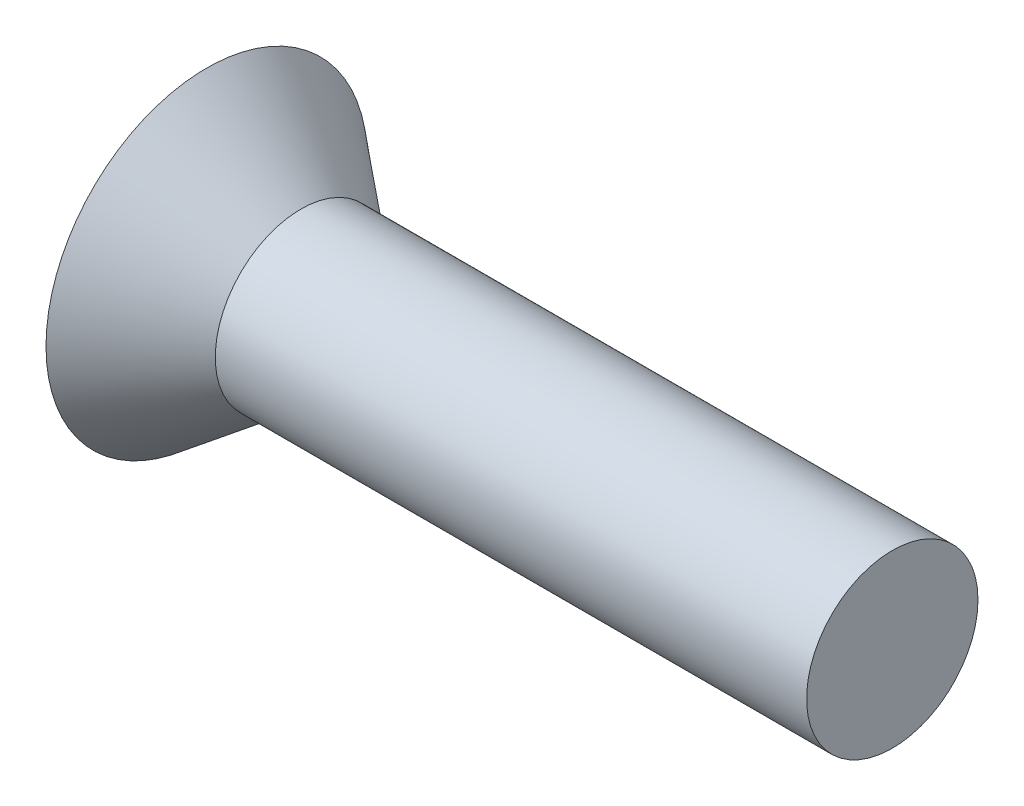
from build123d import *


with BuildPart() as part:
    # Sketch1 → Revolve1 (revolve)
    with BuildSketch(Plane.XY, mode=Mode.PRIVATE) as revolve1_sk:
        Polygon((0, 0), (0, 3.75), (2.2, 2), (16, 2), (16, 0), align=None)
    revolve(revolve1_sk.sketch.rotate(Axis((0, 0, 0), (-1, 0, 0)), 90), axis=Axis((0, 0, 0), (-1, 0, 0)))


solid = part.part
